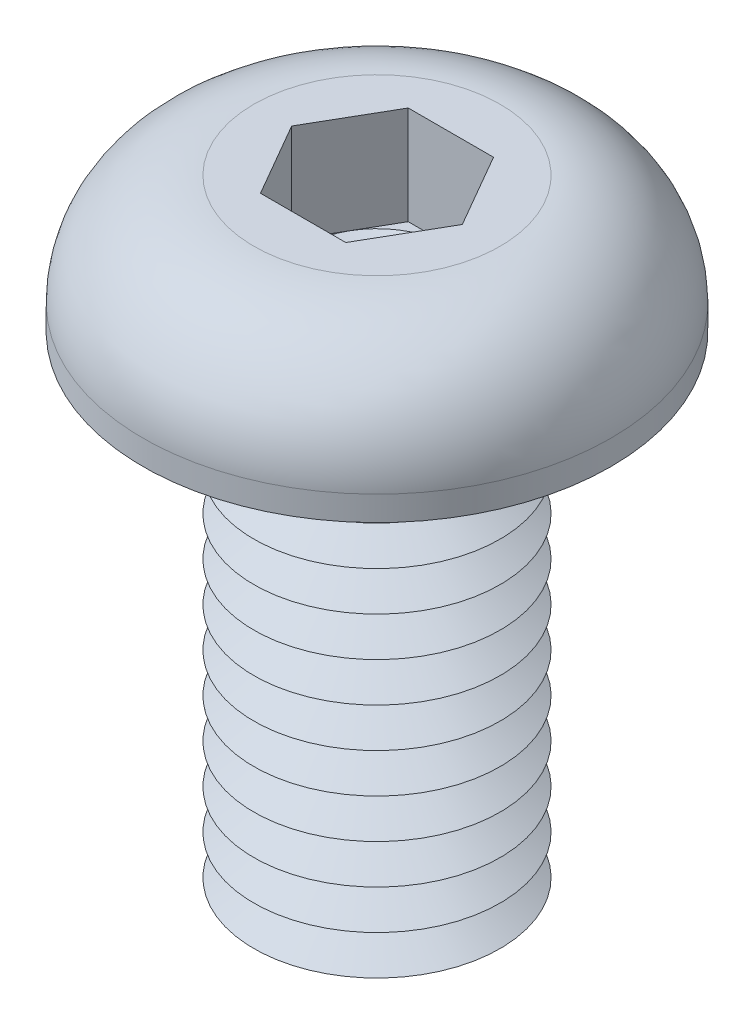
ISO-10303-21;
HEADER;
FILE_DESCRIPTION(('STEP AP214'),'2;1');
FILE_NAME('part.step','',(''),(''),'','','');
FILE_SCHEMA(('AUTOMOTIVE_DESIGN { 1 0 10303 214 1 1 1 1 }'));
ENDSEC;
DATA;
#1=APPLICATION_CONTEXT('core data for automotive mechanical design processes');
#2=APPLICATION_PROTOCOL_DEFINITION('international standard','automotive_design',2000,#1);
#3=PRODUCT_CONTEXT('',#1,'mechanical');
#4=PRODUCT('Part','Part','',(#3));
#5=PRODUCT_RELATED_PRODUCT_CATEGORY('part','',(#4));
#6=PRODUCT_DEFINITION_FORMATION('','',#4);
#7=PRODUCT_DEFINITION_CONTEXT('part definition',#1,'design');
#8=PRODUCT_DEFINITION('design','',#6,#7);
#9=PRODUCT_DEFINITION_SHAPE('','',#8);
#10=(LENGTH_UNIT() NAMED_UNIT(*) SI_UNIT(.MILLI.,.METRE.));
#11=(NAMED_UNIT(*) PLANE_ANGLE_UNIT() SI_UNIT($,.RADIAN.));
#12=(NAMED_UNIT(*) SI_UNIT($,.STERADIAN.) SOLID_ANGLE_UNIT());
#13=UNCERTAINTY_MEASURE_WITH_UNIT(LENGTH_MEASURE(1.E-05),#10,'distance_accuracy_value','');
#14=(GEOMETRIC_REPRESENTATION_CONTEXT(3) GLOBAL_UNCERTAINTY_ASSIGNED_CONTEXT((#13)) GLOBAL_UNIT_ASSIGNED_CONTEXT((#10,
#11,#12)) REPRESENTATION_CONTEXT('',''));
#15=CARTESIAN_POINT('',(0.,0.,0.));
#16=DIRECTION('',(0.,0.,1.));
#17=DIRECTION('',(1.,0.,0.));
#18=AXIS2_PLACEMENT_3D('',#15,#16,#17);
#19=CARTESIAN_POINT('',(0.,0.,0.));
#20=DIRECTION('',(0.,-1.,0.));
#21=DIRECTION('',(0.,0.,-1.));
#22=AXIS2_PLACEMENT_3D('',#19,#20,#21);
#23=TOROIDAL_SURFACE('',#22,2.9,0.4);
#24=CARTESIAN_POINT('',(0.,0.,-3.3));
#25=VERTEX_POINT('',#24);
#26=VERTEX_LOOP('',#25);
#27=FACE_BOUND('',#26,.T.);
#28=ADVANCED_FACE('P0_F12',(#27),#23,.T.);
#29=CLOSED_SHELL('',(#28));
#30=MANIFOLD_SOLID_BREP('P0_B1',#29);
#31=CARTESIAN_POINT('',(0.866025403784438,0.75,-1.5));
#32=DIRECTION('',(0.,1.,0.));
#33=DIRECTION('',(0.,0.,1.));
#34=AXIS2_PLACEMENT_3D('',#31,#32,#33);
#35=PLANE('',#34);
#36=CARTESIAN_POINT('',(0.,0.75,0.));
#37=DIRECTION('',(0.,1.,0.));
#38=DIRECTION('',(0.,0.,1.));
#39=AXIS2_PLACEMENT_3D('',#36,#37,#38);
#40=CIRCLE('',#39,1.5);
#41=CARTESIAN_POINT('',(0.,0.75,1.5));
#42=VERTEX_POINT('',#41);
#43=CARTESIAN_POINT('',(1.29903810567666,0.75,0.75));
#44=VERTEX_POINT('',#43);
#45=EDGE_CURVE('P1_E93',#42,#44,#40,.T.);
#46=ORIENTED_EDGE('',*,*,#45,.F.);
#47=DIRECTION('',(1.,0.,0.));
#48=VECTOR('',#47,1.);
#49=CARTESIAN_POINT('',(-0.866025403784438,0.75,1.5));
#50=LINE('',#49,#48);
#51=CARTESIAN_POINT('',(0.866025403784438,0.75,1.5));
#52=VERTEX_POINT('',#51);
#53=EDGE_CURVE('P1_E116',#42,#52,#50,.T.);
#54=ORIENTED_EDGE('',*,*,#53,.T.);
#55=DIRECTION('',(0.5,0.,-0.866025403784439));
#56=VECTOR('',#55,1.);
#57=CARTESIAN_POINT('',(0.866025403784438,0.75,1.5));
#58=LINE('',#57,#56);
#59=EDGE_CURVE('P1_E112',#52,#44,#58,.T.);
#60=ORIENTED_EDGE('',*,*,#59,.T.);
#61=EDGE_LOOP('',(#46,#54,#60));
#62=FACE_BOUND('',#61,.T.);
#63=ADVANCED_FACE('P1_F15',(#62),#35,.T.);
#64=CARTESIAN_POINT('',(0.,0.75,0.));
#65=DIRECTION('',(0.,1.,0.));
#66=DIRECTION('',(0.,0.,1.));
#67=AXIS2_PLACEMENT_3D('',#64,#65,#66);
#68=CIRCLE('',#67,1.5);
#69=CARTESIAN_POINT('',(1.29903810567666,0.75,-0.750000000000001));
#70=VERTEX_POINT('',#69);
#71=EDGE_CURVE('P1_E10',#44,#70,#68,.T.);
#72=ORIENTED_EDGE('',*,*,#71,.F.);
#73=CARTESIAN_POINT('',(1.73205080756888,0.75,0.));
#74=VERTEX_POINT('',#73);
#75=EDGE_CURVE('P1_E104',#44,#74,#58,.T.);
#76=ORIENTED_EDGE('',*,*,#75,.T.);
#77=DIRECTION('',(-0.5,0.,-0.866025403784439));
#78=VECTOR('',#77,1.);
#79=CARTESIAN_POINT('',(1.73205080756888,0.75,0.));
#80=LINE('',#79,#78);
#81=EDGE_CURVE('P1_E107',#74,#70,#80,.T.);
#82=ORIENTED_EDGE('',*,*,#81,.T.);
#83=EDGE_LOOP('',(#72,#76,#82));
#84=FACE_BOUND('',#83,.T.);
#85=ADVANCED_FACE('P1_F103',(#84),#35,.T.);
#86=CARTESIAN_POINT('',(0.,0.75,-1.5));
#87=VERTEX_POINT('',#86);
#88=EDGE_CURVE('P1_E24',#70,#87,#68,.T.);
#89=ORIENTED_EDGE('',*,*,#88,.F.);
#90=CARTESIAN_POINT('',(0.866025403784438,0.75,-1.5));
#91=VERTEX_POINT('',#90);
#92=EDGE_CURVE('P1_E139',#70,#91,#80,.T.);
#93=ORIENTED_EDGE('',*,*,#92,.T.);
#94=DIRECTION('',(-1.,0.,0.));
#95=VECTOR('',#94,1.);
#96=CARTESIAN_POINT('',(0.866025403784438,0.75,-1.5));
#97=LINE('',#96,#95);
#98=EDGE_CURVE('P1_E294',#91,#87,#97,.T.);
#99=ORIENTED_EDGE('',*,*,#98,.T.);
#100=EDGE_LOOP('',(#89,#93,#99));
#101=FACE_BOUND('',#100,.T.);
#102=ADVANCED_FACE('P1_F259',(#101),#35,.T.);
#103=CARTESIAN_POINT('',(-1.29903810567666,0.75,-0.75));
#104=VERTEX_POINT('',#103);
#105=EDGE_CURVE('P1_E289',#87,#104,#68,.T.);
#106=ORIENTED_EDGE('',*,*,#105,.F.);
#107=CARTESIAN_POINT('',(-0.866025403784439,0.75,-1.5));
#108=VERTEX_POINT('',#107);
#109=EDGE_CURVE('P1_E298',#87,#108,#97,.T.);
#110=ORIENTED_EDGE('',*,*,#109,.T.);
#111=DIRECTION('',(-0.5,0.,0.866025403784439));
#112=VECTOR('',#111,1.);
#113=CARTESIAN_POINT('',(-0.866025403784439,0.75,-1.5));
#114=LINE('',#113,#112);
#115=EDGE_CURVE('P1_E293',#108,#104,#114,.T.);
#116=ORIENTED_EDGE('',*,*,#115,.T.);
#117=EDGE_LOOP('',(#106,#110,#116));
#118=FACE_BOUND('',#117,.T.);
#119=ADVANCED_FACE('P1_F273',(#118),#35,.T.);
#120=CARTESIAN_POINT('',(-1.29903810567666,0.75,0.75));
#121=VERTEX_POINT('',#120);
#122=EDGE_CURVE('P1_E31',#104,#121,#68,.T.);
#123=ORIENTED_EDGE('',*,*,#122,.F.);
#124=CARTESIAN_POINT('',(-1.73205080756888,0.75,0.));
#125=VERTEX_POINT('',#124);
#126=EDGE_CURVE('P1_E285',#104,#125,#114,.T.);
#127=ORIENTED_EDGE('',*,*,#126,.T.);
#128=DIRECTION('',(0.5,0.,0.866025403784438));
#129=VECTOR('',#128,1.);
#130=CARTESIAN_POINT('',(-1.73205080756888,0.75,0.));
#131=LINE('',#130,#129);
#132=EDGE_CURVE('P1_E288',#125,#121,#131,.T.);
#133=ORIENTED_EDGE('',*,*,#132,.T.);
#134=EDGE_LOOP('',(#123,#127,#133));
#135=FACE_BOUND('',#134,.T.);
#136=ADVANCED_FACE('P1_F264',(#135),#35,.T.);
#137=CARTESIAN_POINT('',(0.,-9.2,0.));
#138=DIRECTION('',(0.,1.,0.));
#139=DIRECTION('',(0.,0.,1.));
#140=AXIS2_PLACEMENT_3D('',#137,#138,#139);
#141=CONICAL_SURFACE('',#140,1.80717967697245,1.0471975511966);
#142=CARTESIAN_POINT('',(0.,-8.8,0.));
#143=DIRECTION('',(0.,-1.,0.));
#144=DIRECTION('',(0.,0.,-1.));
#145=AXIS2_PLACEMENT_3D('',#142,#143,#144);
#146=CIRCLE('',#145,2.5);
#147=CARTESIAN_POINT('',(0.,-8.8,-2.5));
#148=VERTEX_POINT('',#147);
#149=EDGE_CURVE('P1_E221',#148,#148,#146,.T.);
#150=ORIENTED_EDGE('',*,*,#149,.T.);
#151=EDGE_LOOP('',(#150));
#152=FACE_BOUND('',#151,.T.);
#153=CARTESIAN_POINT('',(0.,-9.2,0.));
#154=DIRECTION('',(0.,-1.,0.));
#155=DIRECTION('',(0.,0.,-1.));
#156=AXIS2_PLACEMENT_3D('',#153,#154,#155);
#157=CIRCLE('',#156,1.80717967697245);
#158=CARTESIAN_POINT('',(0.,-9.2,-1.80717967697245));
#159=VERTEX_POINT('',#158);
#160=EDGE_CURVE('P1_E224',#159,#159,#157,.T.);
#161=ORIENTED_EDGE('',*,*,#160,.F.);
#162=EDGE_LOOP('',(#161));
#163=FACE_BOUND('',#162,.T.);
#164=ADVANCED_FACE('P1_F272',(#152,#163),#141,.T.);
#165=CARTESIAN_POINT('',(0.,-9.6,0.));
#166=DIRECTION('',(0.,-1.,0.));
#167=DIRECTION('',(0.,0.,-1.));
#168=AXIS2_PLACEMENT_3D('',#165,#166,#167);
#169=CONICAL_SURFACE('',#168,2.5,1.0471975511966);
#170=ORIENTED_EDGE('',*,*,#160,.T.);
#171=EDGE_LOOP('',(#170));
#172=FACE_BOUND('',#171,.T.);
#173=CARTESIAN_POINT('',(0.,-9.6,0.));
#174=DIRECTION('',(0.,-1.,0.));
#175=DIRECTION('',(0.,0.,-1.));
#176=AXIS2_PLACEMENT_3D('',#173,#174,#175);
#177=CIRCLE('',#176,2.5);
#178=CARTESIAN_POINT('',(0.,-9.6,-2.5));
#179=VERTEX_POINT('',#178);
#180=EDGE_CURVE('P1_E227',#179,#179,#177,.T.);
#181=ORIENTED_EDGE('',*,*,#180,.F.);
#182=EDGE_LOOP('',(#181));
#183=FACE_BOUND('',#182,.T.);
#184=ADVANCED_FACE('P1_F279',(#172,#183),#169,.T.);
#185=CARTESIAN_POINT('',(0.,-10.,0.));
#186=DIRECTION('',(0.,1.,0.));
#187=DIRECTION('',(0.,0.,1.));
#188=AXIS2_PLACEMENT_3D('',#185,#186,#187);
#189=PLANE('',#188);
#190=CARTESIAN_POINT('',(0.,-10.,0.));
#191=DIRECTION('',(0.,-1.,0.));
#192=DIRECTION('',(0.,0.,-1.));
#193=AXIS2_PLACEMENT_3D('',#190,#191,#192);
#194=CIRCLE('',#193,1.80717967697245);
#195=CARTESIAN_POINT('',(0.,-10.,-1.80717967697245));
#196=VERTEX_POINT('',#195);
#197=EDGE_CURVE('P1_E230',#196,#196,#194,.T.);
#198=ORIENTED_EDGE('',*,*,#197,.T.);
#199=EDGE_LOOP('',(#198));
#200=FACE_BOUND('',#199,.T.);
#201=ADVANCED_FACE('P1_F357',(#200),#189,.F.);
#202=CARTESIAN_POINT('',(0.,-10.,0.));
#203=DIRECTION('',(0.,1.,0.));
#204=DIRECTION('',(0.,0.,1.));
#205=AXIS2_PLACEMENT_3D('',#202,#203,#204);
#206=CONICAL_SURFACE('',#205,1.80717967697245,1.0471975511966);
#207=ORIENTED_EDGE('',*,*,#180,.T.);
#208=EDGE_LOOP('',(#207));
#209=FACE_BOUND('',#208,.T.);
#210=ORIENTED_EDGE('',*,*,#197,.F.);
#211=EDGE_LOOP('',(#210));
#212=FACE_BOUND('',#211,.T.);
#213=ADVANCED_FACE('P1_F368',(#209,#212),#206,.T.);
#214=CARTESIAN_POINT('',(0.,-8.4,0.));
#215=DIRECTION('',(0.,1.,0.));
#216=DIRECTION('',(0.,0.,1.));
#217=AXIS2_PLACEMENT_3D('',#214,#215,#216);
#218=CONICAL_SURFACE('',#217,1.80717967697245,1.0471975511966);
#219=CARTESIAN_POINT('',(0.,-8.,0.));
#220=DIRECTION('',(0.,-1.,0.));
#221=DIRECTION('',(0.,0.,-1.));
#222=AXIS2_PLACEMENT_3D('',#219,#220,#221);
#223=CIRCLE('',#222,2.5);
#224=CARTESIAN_POINT('',(0.,-8.,-2.5));
#225=VERTEX_POINT('',#224);
#226=EDGE_CURVE('P1_E215',#225,#225,#223,.T.);
#227=ORIENTED_EDGE('',*,*,#226,.T.);
#228=EDGE_LOOP('',(#227));
#229=FACE_BOUND('',#228,.T.);
#230=CARTESIAN_POINT('',(0.,-8.4,0.));
#231=DIRECTION('',(0.,-1.,0.));
#232=DIRECTION('',(0.,0.,-1.));
#233=AXIS2_PLACEMENT_3D('',#230,#231,#232);
#234=CIRCLE('',#233,1.80717967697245);
#235=CARTESIAN_POINT('',(0.,-8.4,-1.80717967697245));
#236=VERTEX_POINT('',#235);
#237=EDGE_CURVE('P1_E218',#236,#236,#234,.T.);
#238=ORIENTED_EDGE('',*,*,#237,.F.);
#239=EDGE_LOOP('',(#238));
#240=FACE_BOUND('',#239,.T.);
#241=ADVANCED_FACE('P1_F377',(#229,#240),#218,.T.);
#242=CARTESIAN_POINT('',(0.,-8.8,0.));
#243=DIRECTION('',(0.,-1.,0.));
#244=DIRECTION('',(0.,0.,-1.));
#245=AXIS2_PLACEMENT_3D('',#242,#243,#244);
#246=CONICAL_SURFACE('',#245,2.5,1.0471975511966);
#247=ORIENTED_EDGE('',*,*,#237,.T.);
#248=EDGE_LOOP('',(#247));
#249=FACE_BOUND('',#248,.T.);
#250=ORIENTED_EDGE('',*,*,#149,.F.);
#251=EDGE_LOOP('',(#250));
#252=FACE_BOUND('',#251,.T.);
#253=ADVANCED_FACE('P1_F386',(#249,#252),#246,.T.);
#254=CARTESIAN_POINT('',(0.,-7.6,0.));
#255=DIRECTION('',(0.,1.,0.));
#256=DIRECTION('',(0.,0.,1.));
#257=AXIS2_PLACEMENT_3D('',#254,#255,#256);
#258=CONICAL_SURFACE('',#257,1.80717967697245,1.0471975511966);
#259=CARTESIAN_POINT('',(0.,-7.2,0.));
#260=DIRECTION('',(0.,-1.,0.));
#261=DIRECTION('',(0.,0.,-1.));
#262=AXIS2_PLACEMENT_3D('',#259,#260,#261);
#263=CIRCLE('',#262,2.5);
#264=CARTESIAN_POINT('',(0.,-7.2,-2.5));
#265=VERTEX_POINT('',#264);
#266=EDGE_CURVE('P1_E209',#265,#265,#263,.T.);
#267=ORIENTED_EDGE('',*,*,#266,.T.);
#268=EDGE_LOOP('',(#267));
#269=FACE_BOUND('',#268,.T.);
#270=CARTESIAN_POINT('',(0.,-7.6,0.));
#271=DIRECTION('',(0.,-1.,0.));
#272=DIRECTION('',(0.,0.,-1.));
#273=AXIS2_PLACEMENT_3D('',#270,#271,#272);
#274=CIRCLE('',#273,1.80717967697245);
#275=CARTESIAN_POINT('',(0.,-7.6,-1.80717967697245));
#276=VERTEX_POINT('',#275);
#277=EDGE_CURVE('P1_E212',#276,#276,#274,.T.);
#278=ORIENTED_EDGE('',*,*,#277,.F.);
#279=EDGE_LOOP('',(#278));
#280=FACE_BOUND('',#279,.T.);
#281=ADVANCED_FACE('P1_F396',(#269,#280),#258,.T.);
#282=CARTESIAN_POINT('',(0.,-8.,0.));
#283=DIRECTION('',(0.,-1.,0.));
#284=DIRECTION('',(0.,0.,-1.));
#285=AXIS2_PLACEMENT_3D('',#282,#283,#284);
#286=CONICAL_SURFACE('',#285,2.5,1.0471975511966);
#287=ORIENTED_EDGE('',*,*,#277,.T.);
#288=EDGE_LOOP('',(#287));
#289=FACE_BOUND('',#288,.T.);
#290=ORIENTED_EDGE('',*,*,#226,.F.);
#291=EDGE_LOOP('',(#290));
#292=FACE_BOUND('',#291,.T.);
#293=ADVANCED_FACE('P1_F406',(#289,#292),#286,.T.);
#294=CARTESIAN_POINT('',(0.,-6.8,0.));
#295=DIRECTION('',(0.,1.,0.));
#296=DIRECTION('',(0.,0.,1.));
#297=AXIS2_PLACEMENT_3D('',#294,#295,#296);
#298=CONICAL_SURFACE('',#297,1.80717967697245,1.0471975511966);
#299=CARTESIAN_POINT('',(0.,-6.4,0.));
#300=DIRECTION('',(0.,-1.,0.));
#301=DIRECTION('',(0.,0.,-1.));
#302=AXIS2_PLACEMENT_3D('',#299,#300,#301);
#303=CIRCLE('',#302,2.5);
#304=CARTESIAN_POINT('',(0.,-6.4,-2.5));
#305=VERTEX_POINT('',#304);
#306=EDGE_CURVE('P1_E203',#305,#305,#303,.T.);
#307=ORIENTED_EDGE('',*,*,#306,.T.);
#308=EDGE_LOOP('',(#307));
#309=FACE_BOUND('',#308,.T.);
#310=CARTESIAN_POINT('',(0.,-6.8,0.));
#311=DIRECTION('',(0.,-1.,0.));
#312=DIRECTION('',(0.,0.,-1.));
#313=AXIS2_PLACEMENT_3D('',#310,#311,#312);
#314=CIRCLE('',#313,1.80717967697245);
#315=CARTESIAN_POINT('',(0.,-6.8,-1.80717967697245));
#316=VERTEX_POINT('',#315);
#317=EDGE_CURVE('P1_E206',#316,#316,#314,.T.);
#318=ORIENTED_EDGE('',*,*,#317,.F.);
#319=EDGE_LOOP('',(#318));
#320=FACE_BOUND('',#319,.T.);
#321=ADVANCED_FACE('P1_F416',(#309,#320),#298,.T.);
#322=CARTESIAN_POINT('',(0.,-7.2,0.));
#323=DIRECTION('',(0.,-1.,0.));
#324=DIRECTION('',(0.,0.,-1.));
#325=AXIS2_PLACEMENT_3D('',#322,#323,#324);
#326=CONICAL_SURFACE('',#325,2.5,1.0471975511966);
#327=ORIENTED_EDGE('',*,*,#317,.T.);
#328=EDGE_LOOP('',(#327));
#329=FACE_BOUND('',#328,.T.);
#330=ORIENTED_EDGE('',*,*,#266,.F.);
#331=EDGE_LOOP('',(#330));
#332=FACE_BOUND('',#331,.T.);
#333=ADVANCED_FACE('P1_F426',(#329,#332),#326,.T.);
#334=CARTESIAN_POINT('',(0.,-6.,0.));
#335=DIRECTION('',(0.,1.,0.));
#336=DIRECTION('',(0.,0.,1.));
#337=AXIS2_PLACEMENT_3D('',#334,#335,#336);
#338=CONICAL_SURFACE('',#337,1.80717967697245,1.0471975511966);
#339=CARTESIAN_POINT('',(0.,-5.6,0.));
#340=DIRECTION('',(0.,-1.,0.));
#341=DIRECTION('',(0.,0.,-1.));
#342=AXIS2_PLACEMENT_3D('',#339,#340,#341);
#343=CIRCLE('',#342,2.5);
#344=CARTESIAN_POINT('',(0.,-5.6,-2.5));
#345=VERTEX_POINT('',#344);
#346=EDGE_CURVE('P1_E197',#345,#345,#343,.T.);
#347=ORIENTED_EDGE('',*,*,#346,.T.);
#348=EDGE_LOOP('',(#347));
#349=FACE_BOUND('',#348,.T.);
#350=CARTESIAN_POINT('',(0.,-6.,0.));
#351=DIRECTION('',(0.,-1.,0.));
#352=DIRECTION('',(0.,0.,-1.));
#353=AXIS2_PLACEMENT_3D('',#350,#351,#352);
#354=CIRCLE('',#353,1.80717967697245);
#355=CARTESIAN_POINT('',(0.,-6.,-1.80717967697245));
#356=VERTEX_POINT('',#355);
#357=EDGE_CURVE('P1_E200',#356,#356,#354,.T.);
#358=ORIENTED_EDGE('',*,*,#357,.F.);
#359=EDGE_LOOP('',(#358));
#360=FACE_BOUND('',#359,.T.);
#361=ADVANCED_FACE('P1_F436',(#349,#360),#338,.T.);
#362=CARTESIAN_POINT('',(0.,-6.4,0.));
#363=DIRECTION('',(0.,-1.,0.));
#364=DIRECTION('',(0.,0.,-1.));
#365=AXIS2_PLACEMENT_3D('',#362,#363,#364);
#366=CONICAL_SURFACE('',#365,2.5,1.0471975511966);
#367=ORIENTED_EDGE('',*,*,#357,.T.);
#368=EDGE_LOOP('',(#367));
#369=FACE_BOUND('',#368,.T.);
#370=ORIENTED_EDGE('',*,*,#306,.F.);
#371=EDGE_LOOP('',(#370));
#372=FACE_BOUND('',#371,.T.);
#373=ADVANCED_FACE('P1_F446',(#369,#372),#366,.T.);
#374=CARTESIAN_POINT('',(0.,-5.2,0.));
#375=DIRECTION('',(0.,1.,0.));
#376=DIRECTION('',(0.,0.,1.));
#377=AXIS2_PLACEMENT_3D('',#374,#375,#376);
#378=CONICAL_SURFACE('',#377,1.80717967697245,1.0471975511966);
#379=CARTESIAN_POINT('',(0.,-4.8,0.));
#380=DIRECTION('',(0.,-1.,0.));
#381=DIRECTION('',(0.,0.,-1.));
#382=AXIS2_PLACEMENT_3D('',#379,#380,#381);
#383=CIRCLE('',#382,2.5);
#384=CARTESIAN_POINT('',(0.,-4.8,-2.5));
#385=VERTEX_POINT('',#384);
#386=EDGE_CURVE('P1_E191',#385,#385,#383,.T.);
#387=ORIENTED_EDGE('',*,*,#386,.T.);
#388=EDGE_LOOP('',(#387));
#389=FACE_BOUND('',#388,.T.);
#390=CARTESIAN_POINT('',(0.,-5.2,0.));
#391=DIRECTION('',(0.,-1.,0.));
#392=DIRECTION('',(0.,0.,-1.));
#393=AXIS2_PLACEMENT_3D('',#390,#391,#392);
#394=CIRCLE('',#393,1.80717967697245);
#395=CARTESIAN_POINT('',(0.,-5.2,-1.80717967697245));
#396=VERTEX_POINT('',#395);
#397=EDGE_CURVE('P1_E194',#396,#396,#394,.T.);
#398=ORIENTED_EDGE('',*,*,#397,.F.);
#399=EDGE_LOOP('',(#398));
#400=FACE_BOUND('',#399,.T.);
#401=ADVANCED_FACE('P1_F456',(#389,#400),#378,.T.);
#402=CARTESIAN_POINT('',(0.,-5.6,0.));
#403=DIRECTION('',(0.,-1.,0.));
#404=DIRECTION('',(0.,0.,-1.));
#405=AXIS2_PLACEMENT_3D('',#402,#403,#404);
#406=CONICAL_SURFACE('',#405,2.5,1.0471975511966);
#407=ORIENTED_EDGE('',*,*,#397,.T.);
#408=EDGE_LOOP('',(#407));
#409=FACE_BOUND('',#408,.T.);
#410=ORIENTED_EDGE('',*,*,#346,.F.);
#411=EDGE_LOOP('',(#410));
#412=FACE_BOUND('',#411,.T.);
#413=ADVANCED_FACE('P1_F466',(#409,#412),#406,.T.);
#414=CARTESIAN_POINT('',(0.,-4.4,0.));
#415=DIRECTION('',(0.,1.,0.));
#416=DIRECTION('',(0.,0.,1.));
#417=AXIS2_PLACEMENT_3D('',#414,#415,#416);
#418=CONICAL_SURFACE('',#417,1.80717967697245,1.0471975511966);
#419=CARTESIAN_POINT('',(0.,-4.,0.));
#420=DIRECTION('',(0.,-1.,0.));
#421=DIRECTION('',(0.,0.,-1.));
#422=AXIS2_PLACEMENT_3D('',#419,#420,#421);
#423=CIRCLE('',#422,2.5);
#424=CARTESIAN_POINT('',(0.,-4.,-2.5));
#425=VERTEX_POINT('',#424);
#426=EDGE_CURVE('P1_E185',#425,#425,#423,.T.);
#427=ORIENTED_EDGE('',*,*,#426,.T.);
#428=EDGE_LOOP('',(#427));
#429=FACE_BOUND('',#428,.T.);
#430=CARTESIAN_POINT('',(0.,-4.4,0.));
#431=DIRECTION('',(0.,-1.,0.));
#432=DIRECTION('',(0.,0.,-1.));
#433=AXIS2_PLACEMENT_3D('',#430,#431,#432);
#434=CIRCLE('',#433,1.80717967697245);
#435=CARTESIAN_POINT('',(0.,-4.4,-1.80717967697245));
#436=VERTEX_POINT('',#435);
#437=EDGE_CURVE('P1_E188',#436,#436,#434,.T.);
#438=ORIENTED_EDGE('',*,*,#437,.F.);
#439=EDGE_LOOP('',(#438));
#440=FACE_BOUND('',#439,.T.);
#441=ADVANCED_FACE('P1_F476',(#429,#440),#418,.T.);
#442=CARTESIAN_POINT('',(0.,-4.8,0.));
#443=DIRECTION('',(0.,-1.,0.));
#444=DIRECTION('',(0.,0.,-1.));
#445=AXIS2_PLACEMENT_3D('',#442,#443,#444);
#446=CONICAL_SURFACE('',#445,2.5,1.0471975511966);
#447=ORIENTED_EDGE('',*,*,#437,.T.);
#448=EDGE_LOOP('',(#447));
#449=FACE_BOUND('',#448,.T.);
#450=ORIENTED_EDGE('',*,*,#386,.F.);
#451=EDGE_LOOP('',(#450));
#452=FACE_BOUND('',#451,.T.);
#453=ADVANCED_FACE('P1_F486',(#449,#452),#446,.T.);
#454=CARTESIAN_POINT('',(0.,-3.6,0.));
#455=DIRECTION('',(0.,1.,0.));
#456=DIRECTION('',(0.,0.,1.));
#457=AXIS2_PLACEMENT_3D('',#454,#455,#456);
#458=CONICAL_SURFACE('',#457,1.80717967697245,1.0471975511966);
#459=CARTESIAN_POINT('',(0.,-3.2,0.));
#460=DIRECTION('',(0.,-1.,0.));
#461=DIRECTION('',(0.,0.,-1.));
#462=AXIS2_PLACEMENT_3D('',#459,#460,#461);
#463=CIRCLE('',#462,2.5);
#464=CARTESIAN_POINT('',(0.,-3.2,-2.5));
#465=VERTEX_POINT('',#464);
#466=EDGE_CURVE('P1_E179',#465,#465,#463,.T.);
#467=ORIENTED_EDGE('',*,*,#466,.T.);
#468=EDGE_LOOP('',(#467));
#469=FACE_BOUND('',#468,.T.);
#470=CARTESIAN_POINT('',(0.,-3.6,0.));
#471=DIRECTION('',(0.,-1.,0.));
#472=DIRECTION('',(0.,0.,-1.));
#473=AXIS2_PLACEMENT_3D('',#470,#471,#472);
#474=CIRCLE('',#473,1.80717967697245);
#475=CARTESIAN_POINT('',(0.,-3.6,-1.80717967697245));
#476=VERTEX_POINT('',#475);
#477=EDGE_CURVE('P1_E182',#476,#476,#474,.T.);
#478=ORIENTED_EDGE('',*,*,#477,.F.);
#479=EDGE_LOOP('',(#478));
#480=FACE_BOUND('',#479,.T.);
#481=ADVANCED_FACE('P1_F496',(#469,#480),#458,.T.);
#482=CARTESIAN_POINT('',(0.,-4.,0.));
#483=DIRECTION('',(0.,-1.,0.));
#484=DIRECTION('',(0.,0.,-1.));
#485=AXIS2_PLACEMENT_3D('',#482,#483,#484);
#486=CONICAL_SURFACE('',#485,2.5,1.0471975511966);
#487=ORIENTED_EDGE('',*,*,#477,.T.);
#488=EDGE_LOOP('',(#487));
#489=FACE_BOUND('',#488,.T.);
#490=ORIENTED_EDGE('',*,*,#426,.F.);
#491=EDGE_LOOP('',(#490));
#492=FACE_BOUND('',#491,.T.);
#493=ADVANCED_FACE('P1_F506',(#489,#492),#486,.T.);
#494=CARTESIAN_POINT('',(0.,-2.8,0.));
#495=DIRECTION('',(0.,1.,0.));
#496=DIRECTION('',(0.,0.,1.));
#497=AXIS2_PLACEMENT_3D('',#494,#495,#496);
#498=CONICAL_SURFACE('',#497,1.80717967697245,1.0471975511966);
#499=CARTESIAN_POINT('',(0.,-2.4,0.));
#500=DIRECTION('',(0.,-1.,0.));
#501=DIRECTION('',(0.,0.,-1.));
#502=AXIS2_PLACEMENT_3D('',#499,#500,#501);
#503=CIRCLE('',#502,2.5);
#504=CARTESIAN_POINT('',(0.,-2.4,-2.5));
#505=VERTEX_POINT('',#504);
#506=EDGE_CURVE('P1_E173',#505,#505,#503,.T.);
#507=ORIENTED_EDGE('',*,*,#506,.T.);
#508=EDGE_LOOP('',(#507));
#509=FACE_BOUND('',#508,.T.);
#510=CARTESIAN_POINT('',(0.,-2.8,0.));
#511=DIRECTION('',(0.,-1.,0.));
#512=DIRECTION('',(0.,0.,-1.));
#513=AXIS2_PLACEMENT_3D('',#510,#511,#512);
#514=CIRCLE('',#513,1.80717967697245);
#515=CARTESIAN_POINT('',(0.,-2.8,-1.80717967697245));
#516=VERTEX_POINT('',#515);
#517=EDGE_CURVE('P1_E176',#516,#516,#514,.T.);
#518=ORIENTED_EDGE('',*,*,#517,.F.);
#519=EDGE_LOOP('',(#518));
#520=FACE_BOUND('',#519,.T.);
#521=ADVANCED_FACE('P1_F516',(#509,#520),#498,.T.);
#522=CARTESIAN_POINT('',(0.,-3.2,0.));
#523=DIRECTION('',(0.,-1.,0.));
#524=DIRECTION('',(0.,0.,-1.));
#525=AXIS2_PLACEMENT_3D('',#522,#523,#524);
#526=CONICAL_SURFACE('',#525,2.5,1.0471975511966);
#527=ORIENTED_EDGE('',*,*,#517,.T.);
#528=EDGE_LOOP('',(#527));
#529=FACE_BOUND('',#528,.T.);
#530=ORIENTED_EDGE('',*,*,#466,.F.);
#531=EDGE_LOOP('',(#530));
#532=FACE_BOUND('',#531,.T.);
#533=ADVANCED_FACE('P1_F526',(#529,#532),#526,.T.);
#534=CARTESIAN_POINT('',(0.,-2.,0.));
#535=DIRECTION('',(0.,1.,0.));
#536=DIRECTION('',(0.,0.,1.));
#537=AXIS2_PLACEMENT_3D('',#534,#535,#536);
#538=CONICAL_SURFACE('',#537,1.80717967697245,1.0471975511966);
#539=CARTESIAN_POINT('',(0.,-1.6,0.));
#540=DIRECTION('',(0.,-1.,0.));
#541=DIRECTION('',(0.,0.,-1.));
#542=AXIS2_PLACEMENT_3D('',#539,#540,#541);
#543=CIRCLE('',#542,2.5);
#544=CARTESIAN_POINT('',(0.,-1.6,-2.5));
#545=VERTEX_POINT('',#544);
#546=EDGE_CURVE('P1_E164',#545,#545,#543,.T.);
#547=ORIENTED_EDGE('',*,*,#546,.T.);
#548=EDGE_LOOP('',(#547));
#549=FACE_BOUND('',#548,.T.);
#550=CARTESIAN_POINT('',(0.,-2.,0.));
#551=DIRECTION('',(0.,-1.,0.));
#552=DIRECTION('',(0.,0.,-1.));
#553=AXIS2_PLACEMENT_3D('',#550,#551,#552);
#554=CIRCLE('',#553,1.80717967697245);
#555=CARTESIAN_POINT('',(0.,-2.,-1.80717967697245));
#556=VERTEX_POINT('',#555);
#557=EDGE_CURVE('P1_E170',#556,#556,#554,.T.);
#558=ORIENTED_EDGE('',*,*,#557,.F.);
#559=EDGE_LOOP('',(#558));
#560=FACE_BOUND('',#559,.T.);
#561=ADVANCED_FACE('P1_F536',(#549,#560),#538,.T.);
#562=CARTESIAN_POINT('',(0.,-2.4,0.));
#563=DIRECTION('',(0.,-1.,0.));
#564=DIRECTION('',(0.,0.,-1.));
#565=AXIS2_PLACEMENT_3D('',#562,#563,#564);
#566=CONICAL_SURFACE('',#565,2.5,1.0471975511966);
#567=ORIENTED_EDGE('',*,*,#557,.T.);
#568=EDGE_LOOP('',(#567));
#569=FACE_BOUND('',#568,.T.);
#570=ORIENTED_EDGE('',*,*,#506,.F.);
#571=EDGE_LOOP('',(#570));
#572=FACE_BOUND('',#571,.T.);
#573=ADVANCED_FACE('P1_F546',(#569,#572),#566,.T.);
#574=CARTESIAN_POINT('',(0.,-1.2,0.));
#575=DIRECTION('',(0.,1.,0.));
#576=DIRECTION('',(0.,0.,1.));
#577=AXIS2_PLACEMENT_3D('',#574,#575,#576);
#578=CONICAL_SURFACE('',#577,1.80717967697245,1.0471975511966);
#579=CARTESIAN_POINT('',(0.,-0.8,0.));
#580=DIRECTION('',(0.,-1.,0.));
#581=DIRECTION('',(0.,0.,-1.));
#582=AXIS2_PLACEMENT_3D('',#579,#580,#581);
#583=CIRCLE('',#582,2.5);
#584=CARTESIAN_POINT('',(0.,-0.8,-2.5));
#585=VERTEX_POINT('',#584);
#586=EDGE_CURVE('P1_E167',#585,#585,#583,.T.);
#587=ORIENTED_EDGE('',*,*,#586,.T.);
#588=EDGE_LOOP('',(#587));
#589=FACE_BOUND('',#588,.T.);
#590=CARTESIAN_POINT('',(0.,-1.2,0.));
#591=DIRECTION('',(0.,-1.,0.));
#592=DIRECTION('',(0.,0.,-1.));
#593=AXIS2_PLACEMENT_3D('',#590,#591,#592);
#594=CIRCLE('',#593,1.80717967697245);
#595=CARTESIAN_POINT('',(0.,-1.2,-1.80717967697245));
#596=VERTEX_POINT('',#595);
#597=EDGE_CURVE('P1_E161',#596,#596,#594,.T.);
#598=ORIENTED_EDGE('',*,*,#597,.F.);
#599=EDGE_LOOP('',(#598));
#600=FACE_BOUND('',#599,.T.);
#601=ADVANCED_FACE('P1_F556',(#589,#600),#578,.T.);
#602=CARTESIAN_POINT('',(0.,-1.6,0.));
#603=DIRECTION('',(0.,-1.,0.));
#604=DIRECTION('',(0.,0.,-1.));
#605=AXIS2_PLACEMENT_3D('',#602,#603,#604);
#606=CONICAL_SURFACE('',#605,2.5,1.0471975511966);
#607=ORIENTED_EDGE('',*,*,#597,.T.);
#608=EDGE_LOOP('',(#607));
#609=FACE_BOUND('',#608,.T.);
#610=ORIENTED_EDGE('',*,*,#546,.F.);
#611=EDGE_LOOP('',(#610));
#612=FACE_BOUND('',#611,.T.);
#613=ADVANCED_FACE('P1_F566',(#609,#612),#606,.T.);
#614=CARTESIAN_POINT('',(0.,-10.,0.));
#615=DIRECTION('',(0.,1.,0.));
#616=DIRECTION('',(0.,0.,1.));
#617=AXIS2_PLACEMENT_3D('',#614,#615,#616);
#618=CYLINDRICAL_SURFACE('',#617,2.5);
#619=CARTESIAN_POINT('',(0.,0.,0.));
#620=DIRECTION('',(0.,-1.,0.));
#621=DIRECTION('',(1.,0.,0.));
#622=AXIS2_PLACEMENT_3D('',#619,#620,#621);
#623=CIRCLE('',#622,2.5);
#624=CARTESIAN_POINT('',(2.5,0.,0.));
#625=VERTEX_POINT('',#624);
#626=EDGE_CURVE('P1_E141',#625,#625,#623,.F.);
#627=ORIENTED_EDGE('',*,*,#626,.F.);
#628=EDGE_LOOP('',(#627));
#629=FACE_BOUND('',#628,.T.);
#630=ORIENTED_EDGE('',*,*,#586,.F.);
#631=EDGE_LOOP('',(#630));
#632=FACE_BOUND('',#631,.T.);
#633=ADVANCED_FACE('P1_F17',(#629,#632),#618,.T.);
#634=CARTESIAN_POINT('',(0.,0.,0.));
#635=DIRECTION('',(0.,-1.,0.));
#636=DIRECTION('',(0.,0.,-1.));
#637=AXIS2_PLACEMENT_3D('',#634,#635,#636);
#638=TOROIDAL_SURFACE('',#637,2.9,0.4);
#639=ORIENTED_EDGE('',*,*,#626,.T.);
#640=EDGE_LOOP('',(#639));
#641=FACE_BOUND('',#640,.T.);
#642=CARTESIAN_POINT('',(0.,0.,0.));
#643=DIRECTION('',(0.,1.,0.));
#644=DIRECTION('',(-1.,0.,0.));
#645=AXIS2_PLACEMENT_3D('',#642,#643,#644);
#646=CIRCLE('',#645,3.3);
#647=CARTESIAN_POINT('',(-3.3,0.,0.));
#648=VERTEX_POINT('',#647);
#649=EDGE_CURVE('P1_E151',#648,#648,#646,.F.);
#650=ORIENTED_EDGE('',*,*,#649,.T.);
#651=EDGE_LOOP('',(#650));
#652=FACE_BOUND('',#651,.T.);
#653=ADVANCED_FACE('P1_F235',(#641,#652),#638,.F.);
#654=CARTESIAN_POINT('',(2.5,2.75,0.));
#655=DIRECTION('',(0.,-1.,0.));
#656=DIRECTION('',(1.,0.,0.));
#657=AXIS2_PLACEMENT_3D('',#654,#655,#656);
#658=PLANE('',#657);
#659=DIRECTION('',(-1.,0.,0.));
#660=VECTOR('',#659,1.);
#661=CARTESIAN_POINT('',(0.866025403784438,2.75,-1.5));
#662=LINE('',#661,#660);
#663=CARTESIAN_POINT('',(0.866025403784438,2.75,-1.5));
#664=VERTEX_POINT('',#663);
#665=CARTESIAN_POINT('',(-0.866025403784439,2.75,-1.5));
#666=VERTEX_POINT('',#665);
#667=EDGE_CURVE('P1_E125',#664,#666,#662,.T.);
#668=ORIENTED_EDGE('',*,*,#667,.F.);
#669=DIRECTION('',(-0.5,0.,-0.866025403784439));
#670=VECTOR('',#669,1.);
#671=CARTESIAN_POINT('',(1.73205080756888,2.75,0.));
#672=LINE('',#671,#670);
#673=CARTESIAN_POINT('',(1.73205080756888,2.75,0.));
#674=VERTEX_POINT('',#673);
#675=EDGE_CURVE('P1_E39',#674,#664,#672,.T.);
#676=ORIENTED_EDGE('',*,*,#675,.F.);
#677=DIRECTION('',(0.5,0.,-0.866025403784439));
#678=VECTOR('',#677,1.);
#679=CARTESIAN_POINT('',(0.866025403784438,2.75,1.5));
#680=LINE('',#679,#678);
#681=CARTESIAN_POINT('',(0.866025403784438,2.75,1.5));
#682=VERTEX_POINT('',#681);
#683=EDGE_CURVE('P1_E137',#682,#674,#680,.T.);
#684=ORIENTED_EDGE('',*,*,#683,.F.);
#685=DIRECTION('',(1.,0.,0.));
#686=VECTOR('',#685,1.);
#687=CARTESIAN_POINT('',(-0.866025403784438,2.75,1.5));
#688=LINE('',#687,#686);
#689=CARTESIAN_POINT('',(-0.866025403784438,2.75,1.5));
#690=VERTEX_POINT('',#689);
#691=EDGE_CURVE('P1_E134',#690,#682,#688,.T.);
#692=ORIENTED_EDGE('',*,*,#691,.F.);
#693=DIRECTION('',(0.5,0.,0.866025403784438));
#694=VECTOR('',#693,1.);
#695=CARTESIAN_POINT('',(-1.73205080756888,2.75,0.));
#696=LINE('',#695,#694);
#697=CARTESIAN_POINT('',(-1.73205080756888,2.75,0.));
#698=VERTEX_POINT('',#697);
#699=EDGE_CURVE('P1_E131',#698,#690,#696,.T.);
#700=ORIENTED_EDGE('',*,*,#699,.F.);
#701=DIRECTION('',(-0.5,0.,0.866025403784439));
#702=VECTOR('',#701,1.);
#703=CARTESIAN_POINT('',(-0.866025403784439,2.75,-1.5));
#704=LINE('',#703,#702);
#705=EDGE_CURVE('P1_E128',#666,#698,#704,.T.);
#706=ORIENTED_EDGE('',*,*,#705,.F.);
#707=EDGE_LOOP('',(#668,#676,#684,#692,#700,#706));
#708=FACE_BOUND('',#707,.T.);
#709=CARTESIAN_POINT('',(0.,2.75,0.));
#710=DIRECTION('',(0.,1.,0.));
#711=DIRECTION('',(-1.,0.,0.));
#712=AXIS2_PLACEMENT_3D('',#709,#710,#711);
#713=CIRCLE('',#712,2.5);
#714=CARTESIAN_POINT('',(-2.5,2.75,0.));
#715=VERTEX_POINT('',#714);
#716=EDGE_CURVE('P1_E152',#715,#715,#713,.T.);
#717=ORIENTED_EDGE('',*,*,#716,.T.);
#718=EDGE_LOOP('',(#717));
#719=FACE_BOUND('',#718,.T.);
#720=ADVANCED_FACE('P1_F313',(#708,#719),#658,.F.);
#721=CARTESIAN_POINT('',(0.,0.5,0.));
#722=DIRECTION('',(0.,1.,0.));
#723=DIRECTION('',(-1.,0.,0.));
#724=AXIS2_PLACEMENT_3D('',#721,#722,#723);
#725=TOROIDAL_SURFACE('',#724,2.5,2.25);
#726=ORIENTED_EDGE('',*,*,#716,.F.);
#727=EDGE_LOOP('',(#726));
#728=FACE_BOUND('',#727,.T.);
#729=CARTESIAN_POINT('',(0.,0.5,0.));
#730=DIRECTION('',(0.,1.,0.));
#731=DIRECTION('',(-1.,0.,0.));
#732=AXIS2_PLACEMENT_3D('',#729,#730,#731);
#733=CIRCLE('',#732,4.75);
#734=CARTESIAN_POINT('',(-4.75,0.5,0.));
#735=VERTEX_POINT('',#734);
#736=EDGE_CURVE('P1_E155',#735,#735,#733,.T.);
#737=ORIENTED_EDGE('',*,*,#736,.T.);
#738=EDGE_LOOP('',(#737));
#739=FACE_BOUND('',#738,.T.);
#740=ADVANCED_FACE('P1_F249',(#728,#739),#725,.T.);
#741=CARTESIAN_POINT('',(0.,2.75,0.));
#742=DIRECTION('',(0.,1.,0.));
#743=DIRECTION('',(-1.,0.,0.));
#744=AXIS2_PLACEMENT_3D('',#741,#742,#743);
#745=CYLINDRICAL_SURFACE('',#744,4.75);
#746=ORIENTED_EDGE('',*,*,#736,.F.);
#747=EDGE_LOOP('',(#746));
#748=FACE_BOUND('',#747,.T.);
#749=CARTESIAN_POINT('',(0.,0.,0.));
#750=DIRECTION('',(0.,1.,0.));
#751=DIRECTION('',(-1.,0.,0.));
#752=AXIS2_PLACEMENT_3D('',#749,#750,#751);
#753=CIRCLE('',#752,4.75);
#754=CARTESIAN_POINT('',(-4.75,0.,0.));
#755=VERTEX_POINT('',#754);
#756=EDGE_CURVE('P1_E158',#755,#755,#753,.T.);
#757=ORIENTED_EDGE('',*,*,#756,.T.);
#758=EDGE_LOOP('',(#757));
#759=FACE_BOUND('',#758,.T.);
#760=ADVANCED_FACE('P1_F240',(#748,#759),#745,.T.);
#761=CARTESIAN_POINT('',(0.,0.,0.));
#762=DIRECTION('',(0.,1.,0.));
#763=DIRECTION('',(-1.,0.,0.));
#764=AXIS2_PLACEMENT_3D('',#761,#762,#763);
#765=PLANE('',#764);
#766=ORIENTED_EDGE('',*,*,#756,.F.);
#767=EDGE_LOOP('',(#766));
#768=FACE_BOUND('',#767,.T.);
#769=ORIENTED_EDGE('',*,*,#649,.F.);
#770=EDGE_LOOP('',(#769));
#771=FACE_BOUND('',#770,.T.);
#772=ADVANCED_FACE('P1_F237',(#768,#771),#765,.F.);
#773=CARTESIAN_POINT('',(1.73205080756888,0.75,0.));
#774=DIRECTION('',(0.866025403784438,0.,-0.5));
#775=DIRECTION('',(-0.5,0.,-0.866025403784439));
#776=AXIS2_PLACEMENT_3D('',#773,#774,#775);
#777=PLANE('',#776);
#778=ORIENTED_EDGE('',*,*,#675,.T.);
#779=DIRECTION('',(0.,1.,0.));
#780=VECTOR('',#779,1.);
#781=CARTESIAN_POINT('',(0.866025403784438,0.75,-1.5));
#782=LINE('',#781,#780);
#783=EDGE_CURVE('P1_E118',#91,#664,#782,.T.);
#784=ORIENTED_EDGE('',*,*,#783,.F.);
#785=ORIENTED_EDGE('',*,*,#92,.F.);
#786=ORIENTED_EDGE('',*,*,#81,.F.);
#787=DIRECTION('',(0.,1.,0.));
#788=VECTOR('',#787,1.);
#789=CARTESIAN_POINT('',(1.73205080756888,0.75,0.));
#790=LINE('',#789,#788);
#791=EDGE_CURVE('P1_E113',#74,#674,#790,.T.);
#792=ORIENTED_EDGE('',*,*,#791,.T.);
#793=EDGE_LOOP('',(#778,#784,#785,#786,#792));
#794=FACE_BOUND('',#793,.T.);
#795=ADVANCED_FACE('P1_F239',(#794),#777,.F.);
#796=CARTESIAN_POINT('',(0.866025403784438,0.75,1.5));
#797=DIRECTION('',(0.866025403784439,0.,0.5));
#798=DIRECTION('',(0.5,0.,-0.866025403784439));
#799=AXIS2_PLACEMENT_3D('',#796,#797,#798);
#800=PLANE('',#799);
#801=ORIENTED_EDGE('',*,*,#683,.T.);
#802=ORIENTED_EDGE('',*,*,#791,.F.);
#803=ORIENTED_EDGE('',*,*,#75,.F.);
#804=ORIENTED_EDGE('',*,*,#59,.F.);
#805=DIRECTION('',(0.,1.,0.));
#806=VECTOR('',#805,1.);
#807=CARTESIAN_POINT('',(0.866025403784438,0.75,1.5));
#808=LINE('',#807,#806);
#809=EDGE_CURVE('P1_E142',#52,#682,#808,.T.);
#810=ORIENTED_EDGE('',*,*,#809,.T.);
#811=EDGE_LOOP('',(#801,#802,#803,#804,#810));
#812=FACE_BOUND('',#811,.T.);
#813=ADVANCED_FACE('P1_F111',(#812),#800,.F.);
#814=CARTESIAN_POINT('',(-0.866025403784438,0.75,1.5));
#815=DIRECTION('',(0.,0.,1.));
#816=DIRECTION('',(1.,0.,0.));
#817=AXIS2_PLACEMENT_3D('',#814,#815,#816);
#818=PLANE('',#817);
#819=ORIENTED_EDGE('',*,*,#691,.T.);
#820=ORIENTED_EDGE('',*,*,#809,.F.);
#821=ORIENTED_EDGE('',*,*,#53,.F.);
#822=CARTESIAN_POINT('',(-0.866025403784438,0.75,1.5));
#823=VERTEX_POINT('',#822);
#824=EDGE_CURVE('P1_E114',#823,#42,#50,.T.);
#825=ORIENTED_EDGE('',*,*,#824,.F.);
#826=DIRECTION('',(0.,1.,0.));
#827=VECTOR('',#826,1.);
#828=CARTESIAN_POINT('',(-0.866025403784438,0.75,1.5));
#829=LINE('',#828,#827);
#830=EDGE_CURVE('P1_E144',#823,#690,#829,.T.);
#831=ORIENTED_EDGE('',*,*,#830,.T.);
#832=EDGE_LOOP('',(#819,#820,#821,#825,#831));
#833=FACE_BOUND('',#832,.T.);
#834=ADVANCED_FACE('P1_F308',(#833),#818,.F.);
#835=CARTESIAN_POINT('',(-1.73205080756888,0.75,0.));
#836=DIRECTION('',(-0.866025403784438,0.,0.5));
#837=DIRECTION('',(0.5,0.,0.866025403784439));
#838=AXIS2_PLACEMENT_3D('',#835,#836,#837);
#839=PLANE('',#838);
#840=ORIENTED_EDGE('',*,*,#699,.T.);
#841=ORIENTED_EDGE('',*,*,#830,.F.);
#842=EDGE_CURVE('P1_E300',#121,#823,#131,.T.);
#843=ORIENTED_EDGE('',*,*,#842,.F.);
#844=ORIENTED_EDGE('',*,*,#132,.F.);
#845=DIRECTION('',(0.,1.,0.));
#846=VECTOR('',#845,1.);
#847=CARTESIAN_POINT('',(-1.73205080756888,0.75,0.));
#848=LINE('',#847,#846);
#849=EDGE_CURVE('P1_E146',#125,#698,#848,.T.);
#850=ORIENTED_EDGE('',*,*,#849,.T.);
#851=EDGE_LOOP('',(#840,#841,#843,#844,#850));
#852=FACE_BOUND('',#851,.T.);
#853=ADVANCED_FACE('P1_F644',(#852),#839,.F.);
#854=CARTESIAN_POINT('',(-0.866025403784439,0.75,-1.5));
#855=DIRECTION('',(-0.866025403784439,0.,-0.5));
#856=DIRECTION('',(-0.5,0.,0.866025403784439));
#857=AXIS2_PLACEMENT_3D('',#854,#855,#856);
#858=PLANE('',#857);
#859=ORIENTED_EDGE('',*,*,#705,.T.);
#860=ORIENTED_EDGE('',*,*,#849,.F.);
#861=ORIENTED_EDGE('',*,*,#126,.F.);
#862=ORIENTED_EDGE('',*,*,#115,.F.);
#863=DIRECTION('',(0.,1.,0.));
#864=VECTOR('',#863,1.);
#865=CARTESIAN_POINT('',(-0.866025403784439,0.75,-1.5));
#866=LINE('',#865,#864);
#867=EDGE_CURVE('P1_E119',#108,#666,#866,.T.);
#868=ORIENTED_EDGE('',*,*,#867,.T.);
#869=EDGE_LOOP('',(#859,#860,#861,#862,#868));
#870=FACE_BOUND('',#869,.T.);
#871=ADVANCED_FACE('P1_F268',(#870),#858,.F.);
#872=CARTESIAN_POINT('',(0.866025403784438,0.75,-1.5));
#873=DIRECTION('',(0.,0.,-1.));
#874=DIRECTION('',(-1.,0.,0.));
#875=AXIS2_PLACEMENT_3D('',#872,#873,#874);
#876=PLANE('',#875);
#877=ORIENTED_EDGE('',*,*,#667,.T.);
#878=ORIENTED_EDGE('',*,*,#867,.F.);
#879=ORIENTED_EDGE('',*,*,#109,.F.);
#880=ORIENTED_EDGE('',*,*,#98,.F.);
#881=ORIENTED_EDGE('',*,*,#783,.T.);
#882=EDGE_LOOP('',(#877,#878,#879,#880,#881));
#883=FACE_BOUND('',#882,.T.);
#884=ADVANCED_FACE('P1_F262',(#883),#876,.F.);
#885=EDGE_CURVE('P1_E19',#121,#42,#68,.T.);
#886=ORIENTED_EDGE('',*,*,#885,.F.);
#887=ORIENTED_EDGE('',*,*,#842,.T.);
#888=ORIENTED_EDGE('',*,*,#824,.T.);
#889=EDGE_LOOP('',(#886,#887,#888));
#890=FACE_BOUND('',#889,.T.);
#891=ADVANCED_FACE('P1_F90',(#890),#35,.T.);
#892=CARTESIAN_POINT('',(0.,0.75,0.));
#893=DIRECTION('',(0.,1.,0.));
#894=DIRECTION('',(0.,0.,1.));
#895=AXIS2_PLACEMENT_3D('',#892,#893,#894);
#896=CONICAL_SURFACE('',#895,1.5,1.0471975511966);
#897=CARTESIAN_POINT('',(0.,-0.116025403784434,0.));
#898=VERTEX_POINT('',#897);
#899=VERTEX_LOOP('',#898);
#900=FACE_BOUND('',#899,.T.);
#901=ORIENTED_EDGE('',*,*,#45,.T.);
#902=ORIENTED_EDGE('',*,*,#71,.T.);
#903=ORIENTED_EDGE('',*,*,#88,.T.);
#904=ORIENTED_EDGE('',*,*,#105,.T.);
#905=ORIENTED_EDGE('',*,*,#122,.T.);
#906=ORIENTED_EDGE('',*,*,#885,.T.);
#907=EDGE_LOOP('',(#901,#902,#903,#904,#905,#906));
#908=FACE_BOUND('',#907,.T.);
#909=ADVANCED_FACE('P1_F88',(#900,#908),#896,.F.);
#910=CLOSED_SHELL('',(#63,#85,#102,#119,#136,#164,#184,#201,#213,#241,#253,#281,#293,#321,#333,
#361,#373,#401,#413,#441,#453,#481,#493,#521,#533,#561,#573,#601,#613,#633,#653,#720,#740,#760,
#772,#795,#813,#834,#853,#871,#884,#891,#909));
#911=MANIFOLD_SOLID_BREP('P1_B1',#910);
#912=ADVANCED_BREP_SHAPE_REPRESENTATION('',(#18,#30,#911),#14);
#913=SHAPE_DEFINITION_REPRESENTATION(#9,#912);
ENDSEC;
END-ISO-10303-21;
